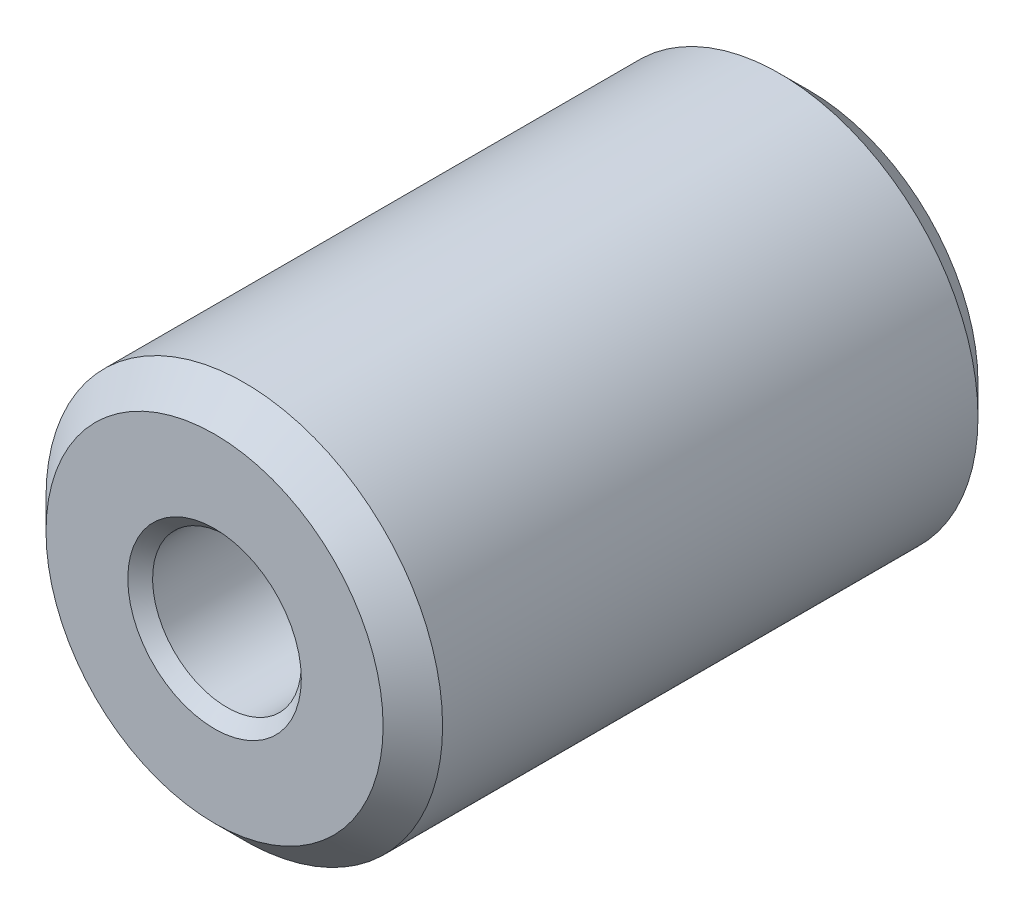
ISO-10303-21;
HEADER;
FILE_DESCRIPTION(('STEP AP214'),'2;1');
FILE_NAME('part.step','',(''),(''),'','','');
FILE_SCHEMA(('AUTOMOTIVE_DESIGN { 1 0 10303 214 1 1 1 1 }'));
ENDSEC;
DATA;
#1=APPLICATION_CONTEXT('core data for automotive mechanical design processes');
#2=APPLICATION_PROTOCOL_DEFINITION('international standard','automotive_design',2000,#1);
#3=PRODUCT_CONTEXT('',#1,'mechanical');
#4=PRODUCT('Part','Part','',(#3));
#5=PRODUCT_RELATED_PRODUCT_CATEGORY('part','',(#4));
#6=PRODUCT_DEFINITION_FORMATION('','',#4);
#7=PRODUCT_DEFINITION_CONTEXT('part definition',#1,'design');
#8=PRODUCT_DEFINITION('design','',#6,#7);
#9=PRODUCT_DEFINITION_SHAPE('','',#8);
#10=(LENGTH_UNIT() NAMED_UNIT(*) SI_UNIT(.MILLI.,.METRE.));
#11=(NAMED_UNIT(*) PLANE_ANGLE_UNIT() SI_UNIT($,.RADIAN.));
#12=(NAMED_UNIT(*) SI_UNIT($,.STERADIAN.) SOLID_ANGLE_UNIT());
#13=UNCERTAINTY_MEASURE_WITH_UNIT(LENGTH_MEASURE(1.E-05),#10,'distance_accuracy_value','');
#14=(GEOMETRIC_REPRESENTATION_CONTEXT(3) GLOBAL_UNCERTAINTY_ASSIGNED_CONTEXT((#13)) GLOBAL_UNIT_ASSIGNED_CONTEXT((#10,
#11,#12)) REPRESENTATION_CONTEXT('',''));
#15=CARTESIAN_POINT('',(0.,0.,0.));
#16=DIRECTION('',(0.,0.,1.));
#17=DIRECTION('',(1.,0.,0.));
#18=AXIS2_PLACEMENT_3D('',#15,#16,#17);
#19=CARTESIAN_POINT('',(0.,0.,12.));
#20=DIRECTION('',(0.,0.,1.));
#21=DIRECTION('',(1.,0.,0.));
#22=AXIS2_PLACEMENT_3D('',#19,#20,#21);
#23=PLANE('',#22);
#24=CARTESIAN_POINT('',(0.,0.,12.));
#25=DIRECTION('',(0.,0.,1.));
#26=DIRECTION('',(1.,0.,0.));
#27=AXIS2_PLACEMENT_3D('',#24,#25,#26);
#28=CIRCLE('',#27,3.4);
#29=CARTESIAN_POINT('',(3.4,0.,12.));
#30=VERTEX_POINT('',#29);
#31=EDGE_CURVE('E19',#30,#30,#28,.T.);
#32=ORIENTED_EDGE('',*,*,#31,.T.);
#33=EDGE_LOOP('',(#32));
#34=FACE_BOUND('',#33,.T.);
#35=CARTESIAN_POINT('',(0.,0.,12.));
#36=DIRECTION('',(0.,0.,-1.));
#37=DIRECTION('',(0.,1.,0.));
#38=AXIS2_PLACEMENT_3D('',#35,#36,#37);
#39=CIRCLE('',#38,1.75);
#40=CARTESIAN_POINT('',(0.,1.75,12.));
#41=VERTEX_POINT('',#40);
#42=EDGE_CURVE('E41',#41,#41,#39,.T.);
#43=ORIENTED_EDGE('',*,*,#42,.T.);
#44=EDGE_LOOP('',(#43));
#45=FACE_BOUND('',#44,.T.);
#46=ADVANCED_FACE('F12',(#34,#45),#23,.T.);
#47=CARTESIAN_POINT('',(0.,0.,12.));
#48=DIRECTION('',(0.,0.,-1.));
#49=DIRECTION('',(-1.,0.,0.));
#50=AXIS2_PLACEMENT_3D('',#47,#48,#49);
#51=CYLINDRICAL_SURFACE('',#50,4.);
#52=CARTESIAN_POINT('',(0.,0.,11.4));
#53=DIRECTION('',(0.,0.,1.));
#54=DIRECTION('',(1.,0.,0.));
#55=AXIS2_PLACEMENT_3D('',#52,#53,#54);
#56=CIRCLE('',#55,4.);
#57=CARTESIAN_POINT('',(4.,0.,11.4));
#58=VERTEX_POINT('',#57);
#59=EDGE_CURVE('E8',#58,#58,#56,.F.);
#60=ORIENTED_EDGE('',*,*,#59,.T.);
#61=EDGE_LOOP('',(#60));
#62=FACE_BOUND('',#61,.T.);
#63=CARTESIAN_POINT('',(0.,0.,0.6));
#64=DIRECTION('',(0.,0.,1.));
#65=DIRECTION('',(1.,0.,0.));
#66=AXIS2_PLACEMENT_3D('',#63,#64,#65);
#67=CIRCLE('',#66,4.);
#68=CARTESIAN_POINT('',(4.,0.,0.6));
#69=VERTEX_POINT('',#68);
#70=EDGE_CURVE('E27',#69,#69,#67,.T.);
#71=ORIENTED_EDGE('',*,*,#70,.T.);
#72=EDGE_LOOP('',(#71));
#73=FACE_BOUND('',#72,.T.);
#74=ADVANCED_FACE('F14',(#62,#73),#51,.T.);
#75=CARTESIAN_POINT('',(0.,0.,0.));
#76=DIRECTION('',(0.,0.,1.));
#77=DIRECTION('',(1.,0.,0.));
#78=AXIS2_PLACEMENT_3D('',#75,#76,#77);
#79=PLANE('',#78);
#80=CARTESIAN_POINT('',(0.,0.,0.));
#81=DIRECTION('',(0.,0.,-1.));
#82=DIRECTION('',(0.,1.,0.));
#83=AXIS2_PLACEMENT_3D('',#80,#81,#82);
#84=CIRCLE('',#83,1.75);
#85=CARTESIAN_POINT('',(0.,1.75,0.));
#86=VERTEX_POINT('',#85);
#87=EDGE_CURVE('E32',#86,#86,#84,.T.);
#88=ORIENTED_EDGE('',*,*,#87,.F.);
#89=EDGE_LOOP('',(#88));
#90=FACE_BOUND('',#89,.T.);
#91=CARTESIAN_POINT('',(0.,0.,0.));
#92=DIRECTION('',(0.,0.,1.));
#93=DIRECTION('',(1.,0.,0.));
#94=AXIS2_PLACEMENT_3D('',#91,#92,#93);
#95=CIRCLE('',#94,3.4);
#96=CARTESIAN_POINT('',(3.4,0.,0.));
#97=VERTEX_POINT('',#96);
#98=EDGE_CURVE('E23',#97,#97,#95,.F.);
#99=ORIENTED_EDGE('',*,*,#98,.T.);
#100=EDGE_LOOP('',(#99));
#101=FACE_BOUND('',#100,.T.);
#102=ADVANCED_FACE('F65',(#90,#101),#79,.F.);
#103=CARTESIAN_POINT('',(0.,0.,0.6));
#104=DIRECTION('',(0.,0.,1.));
#105=DIRECTION('',(1.,0.,0.));
#106=AXIS2_PLACEMENT_3D('',#103,#104,#105);
#107=CONICAL_SURFACE('',#106,4.,0.78539816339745);
#108=ORIENTED_EDGE('',*,*,#98,.F.);
#109=EDGE_LOOP('',(#108));
#110=FACE_BOUND('',#109,.T.);
#111=ORIENTED_EDGE('',*,*,#70,.F.);
#112=EDGE_LOOP('',(#111));
#113=FACE_BOUND('',#112,.T.);
#114=ADVANCED_FACE('F68',(#110,#113),#107,.T.);
#115=CARTESIAN_POINT('',(0.,0.,12.));
#116=DIRECTION('',(0.,0.,-1.));
#117=DIRECTION('',(-1.,0.,0.));
#118=AXIS2_PLACEMENT_3D('',#115,#116,#117);
#119=CONICAL_SURFACE('',#118,3.4,0.785398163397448);
#120=ORIENTED_EDGE('',*,*,#59,.F.);
#121=EDGE_LOOP('',(#120));
#122=FACE_BOUND('',#121,.T.);
#123=ORIENTED_EDGE('',*,*,#31,.F.);
#124=EDGE_LOOP('',(#123));
#125=FACE_BOUND('',#124,.T.);
#126=ADVANCED_FACE('F61',(#122,#125),#119,.T.);
#127=CARTESIAN_POINT('',(0.,0.,0.));
#128=DIRECTION('',(0.,0.,-1.));
#129=DIRECTION('',(0.,1.,0.));
#130=AXIS2_PLACEMENT_3D('',#127,#128,#129);
#131=CONICAL_SURFACE('',#130,1.75,0.785398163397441);
#132=CARTESIAN_POINT('',(0.,0.,0.25));
#133=DIRECTION('',(0.,0.,-1.));
#134=DIRECTION('',(0.,1.,0.));
#135=AXIS2_PLACEMENT_3D('',#132,#133,#134);
#136=CIRCLE('',#135,1.5);
#137=CARTESIAN_POINT('',(0.,1.5,0.25));
#138=VERTEX_POINT('',#137);
#139=EDGE_CURVE('E35',#138,#138,#136,.T.);
#140=ORIENTED_EDGE('',*,*,#139,.F.);
#141=EDGE_LOOP('',(#140));
#142=FACE_BOUND('',#141,.T.);
#143=ORIENTED_EDGE('',*,*,#87,.T.);
#144=EDGE_LOOP('',(#143));
#145=FACE_BOUND('',#144,.T.);
#146=ADVANCED_FACE('F55',(#142,#145),#131,.F.);
#147=CARTESIAN_POINT('',(0.,0.,0.));
#148=DIRECTION('',(0.,0.,-1.));
#149=DIRECTION('',(0.,1.,0.));
#150=AXIS2_PLACEMENT_3D('',#147,#148,#149);
#151=CYLINDRICAL_SURFACE('',#150,1.5);
#152=CARTESIAN_POINT('',(0.,0.,11.75));
#153=DIRECTION('',(0.,0.,-1.));
#154=DIRECTION('',(0.,1.,0.));
#155=AXIS2_PLACEMENT_3D('',#152,#153,#154);
#156=CIRCLE('',#155,1.5);
#157=CARTESIAN_POINT('',(0.,1.5,11.75));
#158=VERTEX_POINT('',#157);
#159=EDGE_CURVE('E38',#158,#158,#156,.T.);
#160=ORIENTED_EDGE('',*,*,#159,.F.);
#161=EDGE_LOOP('',(#160));
#162=FACE_BOUND('',#161,.T.);
#163=ORIENTED_EDGE('',*,*,#139,.T.);
#164=EDGE_LOOP('',(#163));
#165=FACE_BOUND('',#164,.T.);
#166=ADVANCED_FACE('F49',(#162,#165),#151,.F.);
#167=CARTESIAN_POINT('',(0.,0.,11.75));
#168=DIRECTION('',(0.,0.,1.));
#169=DIRECTION('',(0.,-1.,0.));
#170=AXIS2_PLACEMENT_3D('',#167,#168,#169);
#171=CONICAL_SURFACE('',#170,1.5,0.785398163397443);
#172=ORIENTED_EDGE('',*,*,#42,.F.);
#173=EDGE_LOOP('',(#172));
#174=FACE_BOUND('',#173,.T.);
#175=ORIENTED_EDGE('',*,*,#159,.T.);
#176=EDGE_LOOP('',(#175));
#177=FACE_BOUND('',#176,.T.);
#178=ADVANCED_FACE('F46',(#174,#177),#171,.F.);
#179=CLOSED_SHELL('',(#46,#74,#102,#114,#126,#146,#166,#178));
#180=MANIFOLD_SOLID_BREP('B1',#179);
#181=ADVANCED_BREP_SHAPE_REPRESENTATION('',(#18,#180),#14);
#182=SHAPE_DEFINITION_REPRESENTATION(#9,#181);
ENDSEC;
END-ISO-10303-21;
